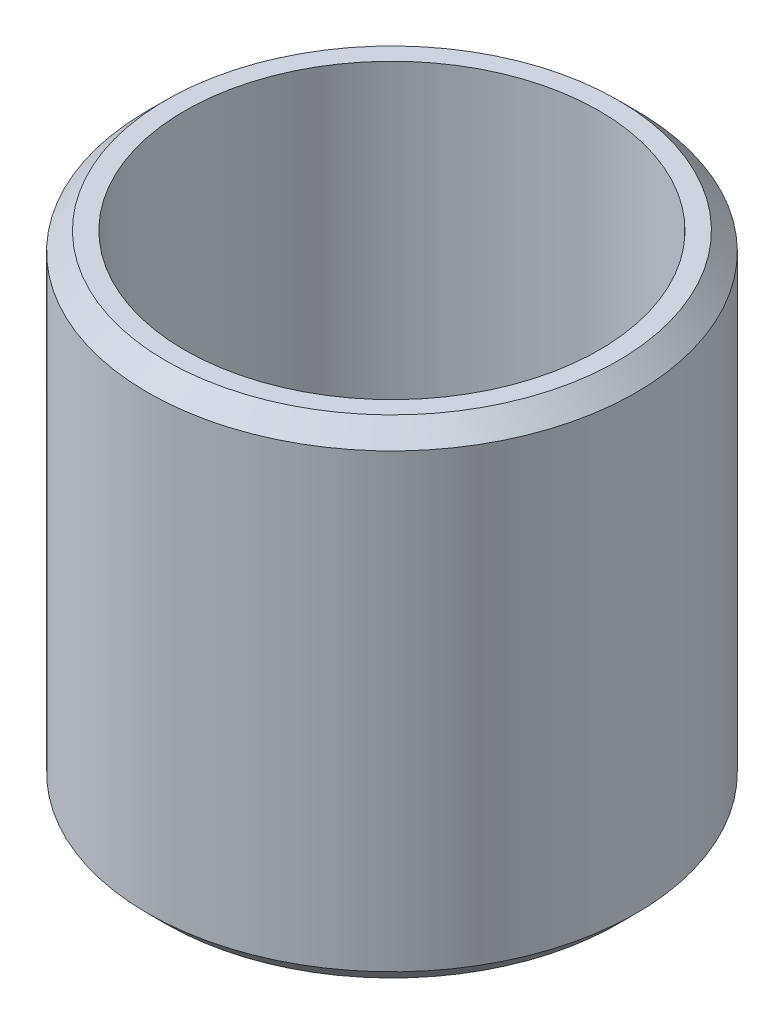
from build123d import *

# Parameters (mm, degrees)
SKETCH1_R            = 20.032
SKETCH1_R_2          = 17
EXTRUDE1_DEPTH       = 20
BUSHING_CHAMFER_SIZE = 1.5


with BuildPart() as part:
    # Sketch1 → Extrude1 (new, symmetric)
    with BuildSketch(Plane(origin=(0, 0, 0), x_dir=(1, 0, 0), z_dir=(0, 1, 0))):
        with Locations(Location((0, 0, 0), (0, 0, 270))):
            Circle(SKETCH1_R)
        with Locations(Location((0, 0, 0), (0, 0, 270))):
            Circle(SKETCH1_R_2, mode=Mode.SUBTRACT)
    extrude(amount=EXTRUDE1_DEPTH, both=True)

    # Bushing Chamfer
    bushing_chamfer_edges = [part.edges().sort_by_distance(p)[0] for p in [
        (0, -20, -20.032),
        (0, 20, -20.032),
    ]]
    chamfer(bushing_chamfer_edges, length=BUSHING_CHAMFER_SIZE)


solid = part.part
